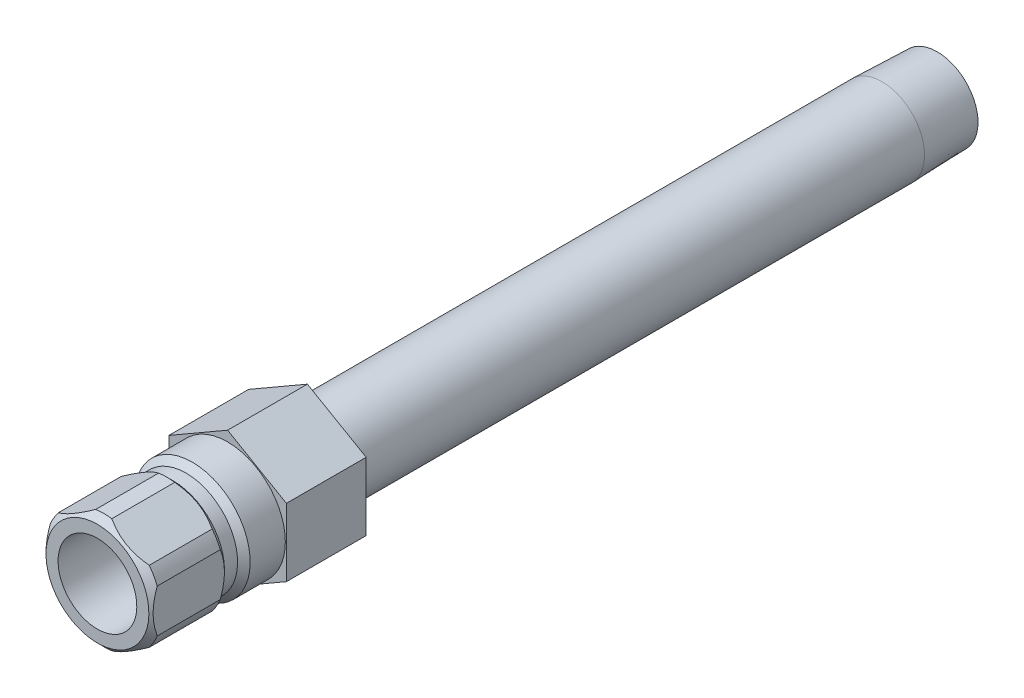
ISO-10303-21;
HEADER;
FILE_DESCRIPTION(('STEP AP214'),'2;1');
FILE_NAME('part.step','',(''),(''),'','','');
FILE_SCHEMA(('AUTOMOTIVE_DESIGN { 1 0 10303 214 1 1 1 1 }'));
ENDSEC;
DATA;
#1=APPLICATION_CONTEXT('core data for automotive mechanical design processes');
#2=APPLICATION_PROTOCOL_DEFINITION('international standard','automotive_design',2000,#1);
#3=PRODUCT_CONTEXT('',#1,'mechanical');
#4=PRODUCT('Part','Part','',(#3));
#5=PRODUCT_RELATED_PRODUCT_CATEGORY('part','',(#4));
#6=PRODUCT_DEFINITION_FORMATION('','',#4);
#7=PRODUCT_DEFINITION_CONTEXT('part definition',#1,'design');
#8=PRODUCT_DEFINITION('design','',#6,#7);
#9=PRODUCT_DEFINITION_SHAPE('','',#8);
#10=(LENGTH_UNIT() NAMED_UNIT(*) SI_UNIT(.MILLI.,.METRE.));
#11=(NAMED_UNIT(*) PLANE_ANGLE_UNIT() SI_UNIT($,.RADIAN.));
#12=(NAMED_UNIT(*) SI_UNIT($,.STERADIAN.) SOLID_ANGLE_UNIT());
#13=UNCERTAINTY_MEASURE_WITH_UNIT(LENGTH_MEASURE(1.E-05),#10,'distance_accuracy_value','');
#14=(GEOMETRIC_REPRESENTATION_CONTEXT(3) GLOBAL_UNCERTAINTY_ASSIGNED_CONTEXT((#13)) GLOBAL_UNIT_ASSIGNED_CONTEXT((#10,
#11,#12)) REPRESENTATION_CONTEXT('',''));
#15=CARTESIAN_POINT('',(0.,0.,0.));
#16=DIRECTION('',(0.,0.,1.));
#17=DIRECTION('',(1.,0.,0.));
#18=AXIS2_PLACEMENT_3D('',#15,#16,#17);
#19=CARTESIAN_POINT('',(0.,0.,-9.652));
#20=DIRECTION('',(0.,0.,-1.));
#21=DIRECTION('',(0.,1.,0.));
#22=AXIS2_PLACEMENT_3D('',#19,#20,#21);
#23=CYLINDRICAL_SURFACE('',#22,6.985);
#24=DIRECTION('',(0.,0.,-1.));
#25=VECTOR('',#24,1.);
#26=CARTESIAN_POINT('',(6.477,2.61509005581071,-9.652));
#27=LINE('',#26,#25);
#28=CARTESIAN_POINT('',(6.477,2.61509005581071,7.366));
#29=VERTEX_POINT('',#28);
#30=CARTESIAN_POINT('',(6.477,2.61509005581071,14.986));
#31=VERTEX_POINT('',#30);
#32=EDGE_CURVE('E372',#29,#31,#27,.F.);
#33=ORIENTED_EDGE('',*,*,#32,.F.);
#34=CARTESIAN_POINT('',(0.,0.,7.366));
#35=DIRECTION('',(0.,0.,-1.));
#36=DIRECTION('',(0.,1.,0.));
#37=AXIS2_PLACEMENT_3D('',#34,#35,#36);
#38=CIRCLE('',#37,6.985);
#39=CARTESIAN_POINT('',(5.50323442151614,4.30170151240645,7.366));
#40=VERTEX_POINT('',#39);
#41=EDGE_CURVE('E190',#40,#29,#38,.T.);
#42=ORIENTED_EDGE('',*,*,#41,.F.);
#43=DIRECTION('',(0.,0.,-1.));
#44=VECTOR('',#43,1.);
#45=CARTESIAN_POINT('',(5.50323442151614,4.30170151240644,-9.652));
#46=LINE('',#45,#44);
#47=CARTESIAN_POINT('',(5.50323442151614,4.30170151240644,14.986));
#48=VERTEX_POINT('',#47);
#49=EDGE_CURVE('E363',#48,#40,#46,.T.);
#50=ORIENTED_EDGE('',*,*,#49,.F.);
#51=CARTESIAN_POINT('',(0.,0.,14.986));
#52=DIRECTION('',(0.,0.,-1.));
#53=DIRECTION('',(0.,1.,0.));
#54=AXIS2_PLACEMENT_3D('',#51,#52,#53);
#55=CIRCLE('',#54,6.985);
#56=EDGE_CURVE('E205',#48,#31,#55,.T.);
#57=ORIENTED_EDGE('',*,*,#56,.T.);
#58=EDGE_LOOP('',(#33,#42,#50,#57));
#59=FACE_BOUND('',#58,.T.);
#60=ADVANCED_FACE('F34',(#59),#23,.T.);
#61=DIRECTION('',(0.,0.,-1.));
#62=VECTOR('',#61,1.);
#63=CARTESIAN_POINT('',(0.97376557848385,6.91679156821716,-9.652));
#64=LINE('',#63,#62);
#65=CARTESIAN_POINT('',(0.973765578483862,6.91679156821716,7.366));
#66=VERTEX_POINT('',#65);
#67=CARTESIAN_POINT('',(0.97376557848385,6.91679156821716,14.986));
#68=VERTEX_POINT('',#67);
#69=EDGE_CURVE('E283',#66,#68,#64,.F.);
#70=ORIENTED_EDGE('',*,*,#69,.F.);
#71=CARTESIAN_POINT('',(-0.973765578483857,6.91679156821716,7.366));
#72=VERTEX_POINT('',#71);
#73=EDGE_CURVE('E194',#72,#66,#38,.T.);
#74=ORIENTED_EDGE('',*,*,#73,.F.);
#75=DIRECTION('',(0.,0.,-1.));
#76=VECTOR('',#75,1.);
#77=CARTESIAN_POINT('',(-0.97376557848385,6.91679156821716,-9.652));
#78=LINE('',#77,#76);
#79=CARTESIAN_POINT('',(-0.97376557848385,6.91679156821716,14.986));
#80=VERTEX_POINT('',#79);
#81=EDGE_CURVE('E54',#80,#72,#78,.T.);
#82=ORIENTED_EDGE('',*,*,#81,.F.);
#83=EDGE_CURVE('E193',#80,#68,#55,.T.);
#84=ORIENTED_EDGE('',*,*,#83,.T.);
#85=EDGE_LOOP('',(#70,#74,#82,#84));
#86=FACE_BOUND('',#85,.T.);
#87=ADVANCED_FACE('F317',(#86),#23,.T.);
#88=DIRECTION('',(0.,0.,-1.));
#89=VECTOR('',#88,1.);
#90=CARTESIAN_POINT('',(-5.50323442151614,4.30170151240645,-9.652));
#91=LINE('',#90,#89);
#92=CARTESIAN_POINT('',(-5.50323442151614,4.30170151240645,7.366));
#93=VERTEX_POINT('',#92);
#94=CARTESIAN_POINT('',(-5.50323442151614,4.30170151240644,14.986));
#95=VERTEX_POINT('',#94);
#96=EDGE_CURVE('E361',#93,#95,#91,.F.);
#97=ORIENTED_EDGE('',*,*,#96,.F.);
#98=CARTESIAN_POINT('',(-6.477,2.6150900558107,7.366));
#99=VERTEX_POINT('',#98);
#100=EDGE_CURVE('E199',#99,#93,#38,.T.);
#101=ORIENTED_EDGE('',*,*,#100,.F.);
#102=DIRECTION('',(0.,0.,-1.));
#103=VECTOR('',#102,1.);
#104=CARTESIAN_POINT('',(-6.477,2.61509005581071,-9.652));
#105=LINE('',#104,#103);
#106=CARTESIAN_POINT('',(-6.477,2.6150900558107,14.986));
#107=VERTEX_POINT('',#106);
#108=EDGE_CURVE('E62',#107,#99,#105,.T.);
#109=ORIENTED_EDGE('',*,*,#108,.F.);
#110=EDGE_CURVE('E204',#107,#95,#55,.T.);
#111=ORIENTED_EDGE('',*,*,#110,.T.);
#112=EDGE_LOOP('',(#97,#101,#109,#111));
#113=FACE_BOUND('',#112,.T.);
#114=ADVANCED_FACE('F322',(#113),#23,.T.);
#115=DIRECTION('',(0.,0.,-1.));
#116=VECTOR('',#115,1.);
#117=CARTESIAN_POINT('',(-6.477,-2.61509005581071,-9.652));
#118=LINE('',#117,#116);
#119=CARTESIAN_POINT('',(-6.477,-2.61509005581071,7.366));
#120=VERTEX_POINT('',#119);
#121=CARTESIAN_POINT('',(-6.477,-2.61509005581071,14.986));
#122=VERTEX_POINT('',#121);
#123=EDGE_CURVE('E353',#120,#122,#118,.F.);
#124=ORIENTED_EDGE('',*,*,#123,.F.);
#125=CARTESIAN_POINT('',(-5.50323442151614,-4.30170151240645,7.366));
#126=VERTEX_POINT('',#125);
#127=EDGE_CURVE('E195',#126,#120,#38,.T.);
#128=ORIENTED_EDGE('',*,*,#127,.F.);
#129=DIRECTION('',(0.,0.,-1.));
#130=VECTOR('',#129,1.);
#131=CARTESIAN_POINT('',(-5.50323442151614,-4.30170151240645,-9.652));
#132=LINE('',#131,#130);
#133=CARTESIAN_POINT('',(-5.50323442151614,-4.30170151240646,14.986));
#134=VERTEX_POINT('',#133);
#135=EDGE_CURVE('E239',#134,#126,#132,.T.);
#136=ORIENTED_EDGE('',*,*,#135,.F.);
#137=EDGE_CURVE('E367',#134,#122,#55,.T.);
#138=ORIENTED_EDGE('',*,*,#137,.T.);
#139=EDGE_LOOP('',(#124,#128,#136,#138));
#140=FACE_BOUND('',#139,.T.);
#141=ADVANCED_FACE('F332',(#140),#23,.T.);
#142=DIRECTION('',(0.,0.,-1.));
#143=VECTOR('',#142,1.);
#144=CARTESIAN_POINT('',(-0.973765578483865,-6.91679156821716,-9.652));
#145=LINE('',#144,#143);
#146=CARTESIAN_POINT('',(-0.973765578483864,-6.91679156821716,7.366));
#147=VERTEX_POINT('',#146);
#148=CARTESIAN_POINT('',(-0.973765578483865,-6.91679156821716,14.986));
#149=VERTEX_POINT('',#148);
#150=EDGE_CURVE('E342',#147,#149,#145,.F.);
#151=ORIENTED_EDGE('',*,*,#150,.F.);
#152=CARTESIAN_POINT('',(0.973765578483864,-6.91679156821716,7.366));
#153=VERTEX_POINT('',#152);
#154=EDGE_CURVE('E191',#153,#147,#38,.T.);
#155=ORIENTED_EDGE('',*,*,#154,.F.);
#156=DIRECTION('',(0.,0.,-1.));
#157=VECTOR('',#156,1.);
#158=CARTESIAN_POINT('',(0.973765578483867,-6.91679156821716,-9.652));
#159=LINE('',#158,#157);
#160=CARTESIAN_POINT('',(0.973765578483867,-6.91679156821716,14.986));
#161=VERTEX_POINT('',#160);
#162=EDGE_CURVE('E168',#161,#153,#159,.T.);
#163=ORIENTED_EDGE('',*,*,#162,.F.);
#164=EDGE_CURVE('E344',#161,#149,#55,.T.);
#165=ORIENTED_EDGE('',*,*,#164,.T.);
#166=EDGE_LOOP('',(#151,#155,#163,#165));
#167=FACE_BOUND('',#166,.T.);
#168=ADVANCED_FACE('F326',(#167),#23,.T.);
#169=CARTESIAN_POINT('',(0.,0.,-9.652));
#170=DIRECTION('',(0.,0.,-1.));
#171=DIRECTION('',(0.,1.,0.));
#172=AXIS2_PLACEMENT_3D('',#169,#170,#171);
#173=CYLINDRICAL_SURFACE('',#172,4.7625);
#174=CARTESIAN_POINT('',(0.,0.,3.556));
#175=DIRECTION('',(0.,0.,-1.));
#176=DIRECTION('',(0.,1.,0.));
#177=AXIS2_PLACEMENT_3D('',#174,#175,#176);
#178=CIRCLE('',#177,4.7625);
#179=CARTESIAN_POINT('',(0.,4.7625,3.556));
#180=VERTEX_POINT('',#179);
#181=EDGE_CURVE('E420',#180,#180,#178,.T.);
#182=ORIENTED_EDGE('',*,*,#181,.T.);
#183=EDGE_LOOP('',(#182));
#184=FACE_BOUND('',#183,.T.);
#185=CARTESIAN_POINT('',(0.,0.,15.748));
#186=DIRECTION('',(0.,0.,-1.));
#187=DIRECTION('',(0.,1.,0.));
#188=AXIS2_PLACEMENT_3D('',#185,#186,#187);
#189=CIRCLE('',#188,4.7625);
#190=CARTESIAN_POINT('',(0.,4.7625,15.748));
#191=VERTEX_POINT('',#190);
#192=EDGE_CURVE('E209',#191,#191,#189,.T.);
#193=ORIENTED_EDGE('',*,*,#192,.F.);
#194=EDGE_LOOP('',(#193));
#195=FACE_BOUND('',#194,.T.);
#196=ADVANCED_FACE('F36',(#184,#195),#173,.F.);
#197=CARTESIAN_POINT('',(0.,4.7625,15.748));
#198=DIRECTION('',(0.,0.,1.));
#199=DIRECTION('',(0.,-1.,0.));
#200=AXIS2_PLACEMENT_3D('',#197,#198,#199);
#201=PLANE('',#200);
#202=ORIENTED_EDGE('',*,*,#192,.T.);
#203=EDGE_LOOP('',(#202));
#204=FACE_BOUND('',#203,.T.);
#205=CARTESIAN_POINT('',(0.,0.,15.748));
#206=DIRECTION('',(0.,0.,-1.));
#207=DIRECTION('',(0.,1.,0.));
#208=AXIS2_PLACEMENT_3D('',#205,#206,#207);
#209=CIRCLE('',#208,6.223);
#210=CARTESIAN_POINT('',(0.,6.223,15.748));
#211=VERTEX_POINT('',#210);
#212=EDGE_CURVE('E206',#211,#211,#209,.T.);
#213=ORIENTED_EDGE('',*,*,#212,.F.);
#214=EDGE_LOOP('',(#213));
#215=FACE_BOUND('',#214,.T.);
#216=ADVANCED_FACE('F245',(#204,#215),#201,.T.);
#217=CARTESIAN_POINT('',(0.,0.,14.986));
#218=DIRECTION('',(0.,0.,-1.));
#219=DIRECTION('',(0.,1.,0.));
#220=AXIS2_PLACEMENT_3D('',#217,#218,#219);
#221=CONICAL_SURFACE('',#220,6.985,0.785398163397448);
#222=CARTESIAN_POINT('',(6.477,-7.50531717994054,12.0573066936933));
#223=CARTESIAN_POINT('',(6.477,-7.32278230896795,12.1954662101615));
#224=CARTESIAN_POINT('',(6.477,-7.13923073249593,12.3323042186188));
#225=CARTESIAN_POINT('',(6.477,-6.76969107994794,12.6027438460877));
#226=CARTESIAN_POINT('',(6.477,-6.58370240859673,12.7363446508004));
#227=CARTESIAN_POINT('',(6.477,-6.20752484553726,13.0006667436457));
#228=CARTESIAN_POINT('',(6.477,-6.01731457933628,13.1313577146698));
#229=CARTESIAN_POINT('',(6.477,-5.63367369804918,13.3879087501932));
#230=CARTESIAN_POINT('',(6.477,-5.44024331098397,13.5137691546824));
#231=CARTESIAN_POINT('',(6.477,-5.03831720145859,13.7667102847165));
#232=CARTESIAN_POINT('',(6.477,-4.82959841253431,13.8934383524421));
#233=CARTESIAN_POINT('',(6.477,-4.4072839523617,14.1386241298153));
#234=CARTESIAN_POINT('',(6.477,-4.19368750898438,14.2570805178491));
#235=CARTESIAN_POINT('',(6.477,-3.76162676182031,14.4831715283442));
#236=CARTESIAN_POINT('',(6.477,-3.54317924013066,14.5908379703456));
#237=CARTESIAN_POINT('',(6.477,-3.10029556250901,14.7929384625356));
#238=CARTESIAN_POINT('',(6.477,-2.87586219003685,14.8873785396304));
#239=CARTESIAN_POINT('',(6.477,-2.43955826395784,15.0524966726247));
#240=CARTESIAN_POINT('',(6.477,-2.22819339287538,15.1244971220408));
#241=CARTESIAN_POINT('',(6.477,-1.80033354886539,15.2515475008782));
#242=CARTESIAN_POINT('',(6.477,-1.58383822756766,15.3065962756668));
#243=CARTESIAN_POINT('',(6.477,-1.1506339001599,15.3959385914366));
#244=CARTESIAN_POINT('',(6.477,-0.934000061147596,15.4305906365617));
#245=CARTESIAN_POINT('',(6.477,-0.498364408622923,15.4784594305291));
#246=CARTESIAN_POINT('',(6.477,-0.2793630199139,15.4916799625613));
#247=CARTESIAN_POINT('',(6.477,0.150697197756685,15.4956835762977));
#248=CARTESIAN_POINT('',(6.477,0.361748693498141,15.4872823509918));
#249=CARTESIAN_POINT('',(6.477,0.782066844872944,15.4503172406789));
#250=CARTESIAN_POINT('',(6.477,0.991333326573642,15.421751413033));
#251=CARTESIAN_POINT('',(6.477,1.41010575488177,15.3455375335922));
#252=CARTESIAN_POINT('',(6.477,1.6195513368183,15.2975631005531));
#253=CARTESIAN_POINT('',(6.477,2.03387291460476,15.1851046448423));
#254=CARTESIAN_POINT('',(6.477,2.23874927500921,15.1206219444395));
#255=CARTESIAN_POINT('',(6.477,2.66141718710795,14.9715598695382));
#256=CARTESIAN_POINT('',(6.477,2.87875617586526,14.8857103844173));
#257=CARTESIAN_POINT('',(6.477,3.30779766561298,14.7008180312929));
#258=CARTESIAN_POINT('',(6.477,3.51949749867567,14.6017690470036));
#259=CARTESIAN_POINT('',(6.477,3.93828980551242,14.3928329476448));
#260=CARTESIAN_POINT('',(6.477,4.14536521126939,14.282911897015));
#261=CARTESIAN_POINT('',(6.477,4.55475391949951,14.0546596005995));
#262=CARTESIAN_POINT('',(6.477,4.75706796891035,13.93632968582));
#263=CARTESIAN_POINT('',(6.477,5.14761370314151,13.6989609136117));
#264=CARTESIAN_POINT('',(6.477,5.33604552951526,13.580249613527));
#265=CARTESIAN_POINT('',(6.477,5.70967381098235,13.3378251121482));
#266=CARTESIAN_POINT('',(6.477,5.89487001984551,13.2141115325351));
#267=CARTESIAN_POINT('',(6.477,6.26095063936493,12.9635958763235));
#268=CARTESIAN_POINT('',(6.477,6.4418578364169,12.8368269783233));
#269=CARTESIAN_POINT('',(6.477,6.80119835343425,12.5799293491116));
#270=CARTESIAN_POINT('',(6.477,6.97963234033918,12.4498015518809));
#271=CARTESIAN_POINT('',(6.477,7.15703038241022,12.3183002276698));
#272=B_SPLINE_CURVE_WITH_KNOTS('',3,(#222,#223,#224,#225,#226,#227,#228,#229,#230,#231,#232,
#233,#234,#235,#236,#237,#238,#239,#240,#241,#242,#243,#244,#245,#246,#247,#248,#249,#250,#251,
#252,#253,#254,#255,#256,#257,#258,#259,#260,#261,#262,#263,#264,#265,#266,#267,#268,#269,#270,
#271),.UNSPECIFIED.,.F.,.F.,(4,2,2,2,2,2,2,2,2,2,2,2,2,2,2,2,2,2,2,2,2,2,2,2,4),(0.,
0.68679090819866,1.37375281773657,2.06603541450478,2.75826919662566,3.49065471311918,
4.22315698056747,4.95343127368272,5.68337170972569,6.35265989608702,7.02199365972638,
7.67918147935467,8.33625327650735,8.96890298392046,9.60161364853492,10.2454384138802,
10.8892116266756,11.5897073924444,12.2905288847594,12.9936114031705,13.696582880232,
14.3646145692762,15.0326968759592,15.6953618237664,16.3578444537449),.UNSPECIFIED.);
#273=CARTESIAN_POINT('',(6.477,-2.61509005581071,14.986));
#274=VERTEX_POINT('',#273);
#275=EDGE_CURVE('E375',#31,#274,#272,.F.);
#276=ORIENTED_EDGE('',*,*,#275,.F.);
#277=ORIENTED_EDGE('',*,*,#56,.F.);
#278=CARTESIAN_POINT('',(0.973302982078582,6.91705864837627,14.9858));
#279=CARTESIAN_POINT('',(1.1543052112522,6.81255696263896,15.0641166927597));
#280=CARTESIAN_POINT('',(1.3378209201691,6.70660411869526,15.1353544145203));
#281=CARTESIAN_POINT('',(1.70963160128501,6.49193912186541,15.2608524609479));
#282=CARTESIAN_POINT('',(1.89793754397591,6.38322063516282,15.3150691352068));
#283=CARTESIAN_POINT('',(2.27146153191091,6.16756646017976,15.401724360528));
#284=CARTESIAN_POINT('',(2.45655498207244,6.06070270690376,15.4348622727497));
#285=CARTESIAN_POINT('',(2.82844640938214,5.8459910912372,15.4802195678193));
#286=CARTESIAN_POINT('',(3.0152419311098,5.73814464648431,15.4924653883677));
#287=CARTESIAN_POINT('',(3.3948057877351,5.51900335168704,15.4953056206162));
#288=CARTESIAN_POINT('',(3.58757842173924,5.40770601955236,15.4852117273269));
#289=CARTESIAN_POINT('',(3.97148128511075,5.18605959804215,15.4426708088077));
#290=CARTESIAN_POINT('',(4.16260891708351,5.0757120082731,15.4101933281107));
#291=CARTESIAN_POINT('',(4.54854122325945,4.85289388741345,15.3234273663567));
#292=CARTESIAN_POINT('',(4.74321398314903,4.74049951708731,15.268364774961));
#293=CARTESIAN_POINT('',(5.03141021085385,4.5741093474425,15.1720079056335));
#294=CARTESIAN_POINT('',(5.12673323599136,4.51907457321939,15.1376422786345));
#295=CARTESIAN_POINT('',(5.31613879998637,4.40972121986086,15.0647445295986));
#296=CARTESIAN_POINT('',(5.41022179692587,4.35540237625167,15.0262139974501));
#297=CARTESIAN_POINT('',(5.50369701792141,4.30143443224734,14.9858));
#298=B_SPLINE_CURVE_WITH_KNOTS('',3,(#278,#279,#280,#281,#282,#283,#284,#285,#286,#287,#288,
#289,#290,#291,#292,#293,#294,#295,#296,#297),.UNSPECIFIED.,.F.,.F.,(4,2,2,2,2,2,2,2,2,4),(0.,
0.669810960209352,1.34132587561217,1.98920541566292,2.63626449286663,3.30353665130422,
3.97171850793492,4.66502165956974,5.01088265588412,5.35661208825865),.UNSPECIFIED.);
#299=EDGE_CURVE('E275',#68,#48,#298,.T.);
#300=ORIENTED_EDGE('',*,*,#299,.F.);
#301=ORIENTED_EDGE('',*,*,#83,.F.);
#302=CARTESIAN_POINT('',(-5.50369701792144,4.30143443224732,14.9858));
#303=CARTESIAN_POINT('',(-5.32269478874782,4.40593611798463,15.0641166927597));
#304=CARTESIAN_POINT('',(-5.13917907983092,4.51188896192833,15.1353544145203));
#305=CARTESIAN_POINT('',(-4.76736839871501,4.72655395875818,15.2608524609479));
#306=CARTESIAN_POINT('',(-4.57906245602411,4.83527244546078,15.3150691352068));
#307=CARTESIAN_POINT('',(-4.2055384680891,5.05092662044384,15.401724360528));
#308=CARTESIAN_POINT('',(-4.02044501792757,5.15779037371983,15.4348622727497));
#309=CARTESIAN_POINT('',(-3.64855359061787,5.3725019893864,15.4802195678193));
#310=CARTESIAN_POINT('',(-3.46175806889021,5.48034843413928,15.4924653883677));
#311=CARTESIAN_POINT('',(-3.0821942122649,5.69948972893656,15.4953056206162));
#312=CARTESIAN_POINT('',(-2.88942157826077,5.81078706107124,15.4852117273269));
#313=CARTESIAN_POINT('',(-2.50551871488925,6.03243348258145,15.4426708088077));
#314=CARTESIAN_POINT('',(-2.31439108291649,6.1427810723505,15.4101933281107));
#315=CARTESIAN_POINT('',(-1.92845877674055,6.36559919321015,15.3234273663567));
#316=CARTESIAN_POINT('',(-1.73378601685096,6.47799356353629,15.268364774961));
#317=CARTESIAN_POINT('',(-1.44558978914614,6.64438373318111,15.1720079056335));
#318=CARTESIAN_POINT('',(-1.35026676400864,6.69941850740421,15.1376422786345));
#319=CARTESIAN_POINT('',(-1.16086120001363,6.80877186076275,15.0647445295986));
#320=CARTESIAN_POINT('',(-1.06677820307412,6.86309070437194,15.0262139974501));
#321=CARTESIAN_POINT('',(-0.973302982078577,6.91705864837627,14.9858));
#322=B_SPLINE_CURVE_WITH_KNOTS('',3,(#302,#303,#304,#305,#306,#307,#308,#309,#310,#311,#312,
#313,#314,#315,#316,#317,#318,#319,#320,#321),.UNSPECIFIED.,.F.,.F.,(4,2,2,2,2,2,2,2,2,4),(0.,
0.669810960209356,1.34132587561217,1.98920541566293,2.63626449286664,3.30353665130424,
3.97171850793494,4.66502165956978,5.01088265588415,5.35661208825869),.UNSPECIFIED.);
#323=EDGE_CURVE('E267',#95,#80,#322,.T.);
#324=ORIENTED_EDGE('',*,*,#323,.F.);
#325=ORIENTED_EDGE('',*,*,#110,.F.);
#326=CARTESIAN_POINT('',(-6.477,-7.50531717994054,12.0573066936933));
#327=CARTESIAN_POINT('',(-6.477,-7.32278230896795,12.1954662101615));
#328=CARTESIAN_POINT('',(-6.477,-7.13923073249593,12.3323042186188));
#329=CARTESIAN_POINT('',(-6.477,-6.76969107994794,12.6027438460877));
#330=CARTESIAN_POINT('',(-6.477,-6.58370240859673,12.7363446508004));
#331=CARTESIAN_POINT('',(-6.477,-6.20752484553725,13.0006667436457));
#332=CARTESIAN_POINT('',(-6.477,-6.01731457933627,13.1313577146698));
#333=CARTESIAN_POINT('',(-6.477,-5.63367369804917,13.3879087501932));
#334=CARTESIAN_POINT('',(-6.477,-5.44024331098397,13.5137691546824));
#335=CARTESIAN_POINT('',(-6.477,-5.03831720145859,13.7667102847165));
#336=CARTESIAN_POINT('',(-6.477,-4.8295984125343,13.8934383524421));
#337=CARTESIAN_POINT('',(-6.477,-4.4072839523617,14.1386241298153));
#338=CARTESIAN_POINT('',(-6.477,-4.19368750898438,14.2570805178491));
#339=CARTESIAN_POINT('',(-6.477,-3.7616267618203,14.4831715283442));
#340=CARTESIAN_POINT('',(-6.477,-3.54317924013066,14.5908379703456));
#341=CARTESIAN_POINT('',(-6.477,-3.100295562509,14.7929384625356));
#342=CARTESIAN_POINT('',(-6.477,-2.87586219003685,14.8873785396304));
#343=CARTESIAN_POINT('',(-6.477,-2.43955826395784,15.0524966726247));
#344=CARTESIAN_POINT('',(-6.477,-2.22819339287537,15.1244971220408));
#345=CARTESIAN_POINT('',(-6.477,-1.80033354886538,15.2515475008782));
#346=CARTESIAN_POINT('',(-6.477,-1.58383822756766,15.3065962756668));
#347=CARTESIAN_POINT('',(-6.477,-1.15063390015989,15.3959385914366));
#348=CARTESIAN_POINT('',(-6.477,-0.934000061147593,15.4305906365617));
#349=CARTESIAN_POINT('',(-6.477,-0.498364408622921,15.4784594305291));
#350=CARTESIAN_POINT('',(-6.477,-0.279363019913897,15.4916799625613));
#351=CARTESIAN_POINT('',(-6.477,0.150697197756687,15.4956835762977));
#352=CARTESIAN_POINT('',(-6.477,0.361748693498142,15.4872823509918));
#353=CARTESIAN_POINT('',(-6.477,0.782066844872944,15.4503172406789));
#354=CARTESIAN_POINT('',(-6.477,0.991333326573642,15.421751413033));
#355=CARTESIAN_POINT('',(-6.477,1.41010575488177,15.3455375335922));
#356=CARTESIAN_POINT('',(-6.477,1.6195513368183,15.2975631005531));
#357=CARTESIAN_POINT('',(-6.477,2.03387291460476,15.1851046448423));
#358=CARTESIAN_POINT('',(-6.477,2.23874927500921,15.1206219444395));
#359=CARTESIAN_POINT('',(-6.477,2.66141718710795,14.9715598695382));
#360=CARTESIAN_POINT('',(-6.477,2.87875617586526,14.8857103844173));
#361=CARTESIAN_POINT('',(-6.477,3.30779766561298,14.7008180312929));
#362=CARTESIAN_POINT('',(-6.477,3.51949749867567,14.6017690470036));
#363=CARTESIAN_POINT('',(-6.477,3.93828980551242,14.3928329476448));
#364=CARTESIAN_POINT('',(-6.477,4.14536521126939,14.282911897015));
#365=CARTESIAN_POINT('',(-6.477,4.55475391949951,14.0546596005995));
#366=CARTESIAN_POINT('',(-6.477,4.75706796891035,13.93632968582));
#367=CARTESIAN_POINT('',(-6.477,5.14761370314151,13.6989609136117));
#368=CARTESIAN_POINT('',(-6.477,5.33604552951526,13.580249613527));
#369=CARTESIAN_POINT('',(-6.477,5.70967381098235,13.3378251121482));
#370=CARTESIAN_POINT('',(-6.477,5.89487001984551,13.2141115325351));
#371=CARTESIAN_POINT('',(-6.477,6.26095063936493,12.9635958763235));
#372=CARTESIAN_POINT('',(-6.477,6.4418578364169,12.8368269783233));
#373=CARTESIAN_POINT('',(-6.477,6.80119835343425,12.5799293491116));
#374=CARTESIAN_POINT('',(-6.477,6.97963234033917,12.4498015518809));
#375=CARTESIAN_POINT('',(-6.477,7.15703038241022,12.3183002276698));
#376=B_SPLINE_CURVE_WITH_KNOTS('',3,(#326,#327,#328,#329,#330,#331,#332,#333,#334,#335,#336,
#337,#338,#339,#340,#341,#342,#343,#344,#345,#346,#347,#348,#349,#350,#351,#352,#353,#354,#355,
#356,#357,#358,#359,#360,#361,#362,#363,#364,#365,#366,#367,#368,#369,#370,#371,#372,#373,#374,
#375),.UNSPECIFIED.,.F.,.F.,(4,2,2,2,2,2,2,2,2,2,2,2,2,2,2,2,2,2,2,2,2,2,2,2,4),(0.,
0.686790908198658,1.37375281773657,2.06603541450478,2.75826919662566,3.49065471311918,
4.22315698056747,4.95343127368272,5.68337170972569,6.35265989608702,7.02199365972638,
7.67918147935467,8.33625327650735,8.96890298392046,9.60161364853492,10.2454384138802,
10.8892116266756,11.5897073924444,12.2905288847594,12.9936114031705,13.696582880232,
14.3646145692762,15.0326968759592,15.6953618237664,16.3578444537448),.UNSPECIFIED.);
#377=EDGE_CURVE('E260',#122,#107,#376,.T.);
#378=ORIENTED_EDGE('',*,*,#377,.F.);
#379=ORIENTED_EDGE('',*,*,#137,.F.);
#380=CARTESIAN_POINT('',(-0.973302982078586,-6.91705864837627,14.9858));
#381=CARTESIAN_POINT('',(-1.1543052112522,-6.81255696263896,15.0641166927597));
#382=CARTESIAN_POINT('',(-1.3378209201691,-6.70660411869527,15.1353544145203));
#383=CARTESIAN_POINT('',(-1.70963160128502,-6.49193912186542,15.2608524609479));
#384=CARTESIAN_POINT('',(-1.89793754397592,-6.38322063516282,15.3150691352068));
#385=CARTESIAN_POINT('',(-2.27146153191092,-6.16756646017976,15.401724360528));
#386=CARTESIAN_POINT('',(-2.45655498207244,-6.06070270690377,15.4348622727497));
#387=CARTESIAN_POINT('',(-2.82844640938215,-5.8459910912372,15.4802195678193));
#388=CARTESIAN_POINT('',(-3.0152419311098,-5.73814464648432,15.4924653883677));
#389=CARTESIAN_POINT('',(-3.39480578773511,-5.51900335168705,15.4953056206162));
#390=CARTESIAN_POINT('',(-3.58757842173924,-5.40770601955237,15.4852117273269));
#391=CARTESIAN_POINT('',(-3.97148128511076,-5.18605959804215,15.4426708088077));
#392=CARTESIAN_POINT('',(-4.16260891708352,-5.0757120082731,15.4101933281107));
#393=CARTESIAN_POINT('',(-4.54854122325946,-4.85289388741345,15.3234273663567));
#394=CARTESIAN_POINT('',(-4.74321398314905,-4.74049951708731,15.268364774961));
#395=CARTESIAN_POINT('',(-5.03141021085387,-4.57410934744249,15.1720079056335));
#396=CARTESIAN_POINT('',(-5.12673323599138,-4.51907457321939,15.1376422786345));
#397=CARTESIAN_POINT('',(-5.31613879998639,-4.40972121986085,15.0647445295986));
#398=CARTESIAN_POINT('',(-5.4102217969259,-4.35540237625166,15.0262139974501));
#399=CARTESIAN_POINT('',(-5.50369701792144,-4.30143443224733,14.9858));
#400=B_SPLINE_CURVE_WITH_KNOTS('',3,(#380,#381,#382,#383,#384,#385,#386,#387,#388,#389,#390,
#391,#392,#393,#394,#395,#396,#397,#398,#399),.UNSPECIFIED.,.F.,.F.,(4,2,2,2,2,2,2,2,2,4),(0.,
0.669810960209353,1.34132587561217,1.98920541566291,2.63626449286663,3.30353665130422,
3.97171850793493,4.66502165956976,5.01088265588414,5.35661208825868),.UNSPECIFIED.);
#401=EDGE_CURVE('E253',#149,#134,#400,.T.);
#402=ORIENTED_EDGE('',*,*,#401,.F.);
#403=ORIENTED_EDGE('',*,*,#164,.F.);
#404=CARTESIAN_POINT('',(5.50369701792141,-4.30143443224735,14.9858));
#405=CARTESIAN_POINT('',(5.32269478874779,-4.40593611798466,15.0641166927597));
#406=CARTESIAN_POINT('',(5.13917907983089,-4.51188896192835,15.1353544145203));
#407=CARTESIAN_POINT('',(4.76736839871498,-4.7265539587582,15.2608524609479));
#408=CARTESIAN_POINT('',(4.57906245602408,-4.8352724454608,15.3150691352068));
#409=CARTESIAN_POINT('',(4.20553846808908,-5.05092662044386,15.401724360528));
#410=CARTESIAN_POINT('',(4.02044501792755,-5.15779037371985,15.4348622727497));
#411=CARTESIAN_POINT('',(3.64855359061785,-5.37250198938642,15.4802195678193));
#412=CARTESIAN_POINT('',(3.46175806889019,-5.4803484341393,15.4924653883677));
#413=CARTESIAN_POINT('',(3.08219421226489,-5.69948972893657,15.4953056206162));
#414=CARTESIAN_POINT('',(2.88942157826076,-5.81078706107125,15.4852117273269));
#415=CARTESIAN_POINT('',(2.50551871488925,-6.03243348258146,15.4426708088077));
#416=CARTESIAN_POINT('',(2.31439108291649,-6.14278107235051,15.4101933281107));
#417=CARTESIAN_POINT('',(1.92845877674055,-6.36559919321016,15.3234273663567));
#418=CARTESIAN_POINT('',(1.73378601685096,-6.4779935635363,15.268364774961));
#419=CARTESIAN_POINT('',(1.44558978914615,-6.64438373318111,15.1720079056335));
#420=CARTESIAN_POINT('',(1.35026676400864,-6.69941850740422,15.1376422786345));
#421=CARTESIAN_POINT('',(1.16086120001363,-6.80877186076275,15.0647445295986));
#422=CARTESIAN_POINT('',(1.06677820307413,-6.86309070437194,15.0262139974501));
#423=CARTESIAN_POINT('',(0.973302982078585,-6.91705864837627,14.9858));
#424=B_SPLINE_CURVE_WITH_KNOTS('',3,(#404,#405,#406,#407,#408,#409,#410,#411,#412,#413,#414,
#415,#416,#417,#418,#419,#420,#421,#422,#423),.UNSPECIFIED.,.F.,.F.,(4,2,2,2,2,2,2,2,2,4),(0.,
0.669810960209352,1.34132587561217,1.98920541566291,2.63626449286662,3.30353665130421,
3.9717185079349,4.66502165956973,5.0108826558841,5.35661208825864),.UNSPECIFIED.);
#425=CARTESIAN_POINT('',(5.50323442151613,-4.30170151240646,14.986));
#426=VERTEX_POINT('',#425);
#427=EDGE_CURVE('E184',#426,#161,#424,.T.);
#428=ORIENTED_EDGE('',*,*,#427,.F.);
#429=EDGE_CURVE('E183',#274,#426,#55,.T.);
#430=ORIENTED_EDGE('',*,*,#429,.F.);
#431=EDGE_LOOP('',(#276,#277,#300,#301,#324,#325,#378,#379,#402,#403,#428,#430));
#432=FACE_BOUND('',#431,.T.);
#433=ORIENTED_EDGE('',*,*,#212,.T.);
#434=EDGE_LOOP('',(#433));
#435=FACE_BOUND('',#434,.T.);
#436=ADVANCED_FACE('F242',(#432,#435),#221,.T.);
#437=DIRECTION('',(0.,0.,-1.));
#438=VECTOR('',#437,1.);
#439=CARTESIAN_POINT('',(6.477,-2.61509005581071,-9.652));
#440=LINE('',#439,#438);
#441=CARTESIAN_POINT('',(6.477,-2.61509005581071,7.366));
#442=VERTEX_POINT('',#441);
#443=EDGE_CURVE('E282',#274,#442,#440,.T.);
#444=ORIENTED_EDGE('',*,*,#443,.F.);
#445=ORIENTED_EDGE('',*,*,#429,.T.);
#446=DIRECTION('',(0.,0.,-1.));
#447=VECTOR('',#446,1.);
#448=CARTESIAN_POINT('',(5.50323442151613,-4.30170151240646,-9.652));
#449=LINE('',#448,#447);
#450=CARTESIAN_POINT('',(5.50323442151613,-4.30170151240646,7.366));
#451=VERTEX_POINT('',#450);
#452=EDGE_CURVE('E165',#451,#426,#449,.F.);
#453=ORIENTED_EDGE('',*,*,#452,.F.);
#454=EDGE_CURVE('E181',#442,#451,#38,.T.);
#455=ORIENTED_EDGE('',*,*,#454,.F.);
#456=EDGE_LOOP('',(#444,#445,#453,#455));
#457=FACE_BOUND('',#456,.T.);
#458=ADVANCED_FACE('F180',(#457),#23,.T.);
#459=CARTESIAN_POINT('',(0.,0.,6.604));
#460=DIRECTION('',(0.,0.,1.));
#461=DIRECTION('',(0.,-1.,0.));
#462=AXIS2_PLACEMENT_3D('',#459,#460,#461);
#463=CONICAL_SURFACE('',#462,6.223,0.785398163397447);
#464=CARTESIAN_POINT('',(6.477,-7.50531717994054,10.2946933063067));
#465=CARTESIAN_POINT('',(6.477,-7.32278230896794,10.1565337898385));
#466=CARTESIAN_POINT('',(6.477,-7.13923073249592,10.0196957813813));
#467=CARTESIAN_POINT('',(6.477,-6.76969107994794,9.74925615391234));
#468=CARTESIAN_POINT('',(6.477,-6.58370240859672,9.61565534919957));
#469=CARTESIAN_POINT('',(6.477,-6.20752484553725,9.35133325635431));
#470=CARTESIAN_POINT('',(6.477,-6.01731457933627,9.22064228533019));
#471=CARTESIAN_POINT('',(6.477,-5.63367369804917,8.96409124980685));
#472=CARTESIAN_POINT('',(6.477,-5.44024331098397,8.83823084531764));
#473=CARTESIAN_POINT('',(6.477,-5.03831720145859,8.58528971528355));
#474=CARTESIAN_POINT('',(6.477,-4.82959841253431,8.45856164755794));
#475=CARTESIAN_POINT('',(6.477,-4.4072839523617,8.21337587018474));
#476=CARTESIAN_POINT('',(6.477,-4.19368750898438,8.09491948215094));
#477=CARTESIAN_POINT('',(6.477,-3.76162676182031,7.8688284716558));
#478=CARTESIAN_POINT('',(6.477,-3.54317924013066,7.76116202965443));
#479=CARTESIAN_POINT('',(6.477,-3.10029556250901,7.55906153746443));
#480=CARTESIAN_POINT('',(6.477,-2.87586219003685,7.46462146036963));
#481=CARTESIAN_POINT('',(6.477,-2.43955826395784,7.2995033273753));
#482=CARTESIAN_POINT('',(6.477,-2.22819339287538,7.2275028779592));
#483=CARTESIAN_POINT('',(6.477,-1.80033354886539,7.10045249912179));
#484=CARTESIAN_POINT('',(6.477,-1.58383822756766,7.0454037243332));
#485=CARTESIAN_POINT('',(6.477,-1.1506339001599,6.95606140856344));
#486=CARTESIAN_POINT('',(6.477,-0.934000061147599,6.92140936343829));
#487=CARTESIAN_POINT('',(6.477,-0.498364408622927,6.87354056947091));
#488=CARTESIAN_POINT('',(6.477,-0.279363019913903,6.86032003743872));
#489=CARTESIAN_POINT('',(6.477,0.15069719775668,6.85631642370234));
#490=CARTESIAN_POINT('',(6.477,0.361748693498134,6.8647176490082));
#491=CARTESIAN_POINT('',(6.477,0.782066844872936,6.90168275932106));
#492=CARTESIAN_POINT('',(6.477,0.991333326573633,6.93024858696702));
#493=CARTESIAN_POINT('',(6.477,1.41010575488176,7.00646246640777));
#494=CARTESIAN_POINT('',(6.477,1.61955133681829,7.05443689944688));
#495=CARTESIAN_POINT('',(6.477,2.03387291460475,7.16689535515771));
#496=CARTESIAN_POINT('',(6.477,2.2387492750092,7.23137805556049));
#497=CARTESIAN_POINT('',(6.477,2.66141718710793,7.38044013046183));
#498=CARTESIAN_POINT('',(6.477,2.87875617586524,7.46628961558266));
#499=CARTESIAN_POINT('',(6.477,3.30779766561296,7.65118196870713));
#500=CARTESIAN_POINT('',(6.477,3.51949749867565,7.75023095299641));
#501=CARTESIAN_POINT('',(6.477,3.93828980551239,7.95916705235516));
#502=CARTESIAN_POINT('',(6.477,4.14536521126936,8.069088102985));
#503=CARTESIAN_POINT('',(6.477,4.55475391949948,8.29734039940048));
#504=CARTESIAN_POINT('',(6.477,4.75706796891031,8.41567031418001));
#505=CARTESIAN_POINT('',(6.477,5.14761370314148,8.65303908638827));
#506=CARTESIAN_POINT('',(6.477,5.33604552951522,8.77175038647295));
#507=CARTESIAN_POINT('',(6.477,5.70967381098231,9.01417488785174));
#508=CARTESIAN_POINT('',(6.477,5.89487001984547,9.13788846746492));
#509=CARTESIAN_POINT('',(6.477,6.26095063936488,9.38840412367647));
#510=CARTESIAN_POINT('',(6.477,6.44185783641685,9.5151730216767));
#511=CARTESIAN_POINT('',(6.477,6.8011983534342,9.77207065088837));
#512=CARTESIAN_POINT('',(6.477,6.97963234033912,9.90219844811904));
#513=CARTESIAN_POINT('',(6.477,7.15703038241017,10.0336997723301));
#514=B_SPLINE_CURVE_WITH_KNOTS('',3,(#464,#465,#466,#467,#468,#469,#470,#471,#472,#473,#474,
#475,#476,#477,#478,#479,#480,#481,#482,#483,#484,#485,#486,#487,#488,#489,#490,#491,#492,#493,
#494,#495,#496,#497,#498,#499,#500,#501,#502,#503,#504,#505,#506,#507,#508,#509,#510,#511,#512,
#513),.UNSPECIFIED.,.F.,.F.,(4,2,2,2,2,2,2,2,2,2,2,2,2,2,2,2,2,2,2,2,2,2,2,2,4),(0.,
0.686790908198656,1.37375281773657,2.06603541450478,2.75826919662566,3.49065471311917,
4.22315698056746,4.95343127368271,5.68337170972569,6.35265989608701,7.02199365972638,
7.67918147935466,8.33625327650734,8.96890298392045,9.6016136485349,10.2454384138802,
10.8892116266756,11.5897073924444,12.2905288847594,12.9936114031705,13.6965828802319,
14.3646145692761,15.0326968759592,15.6953618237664,16.3578444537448),.UNSPECIFIED.);
#515=EDGE_CURVE('E12',#442,#29,#514,.T.);
#516=ORIENTED_EDGE('',*,*,#515,.F.);
#517=ORIENTED_EDGE('',*,*,#454,.T.);
#518=CARTESIAN_POINT('',(0.973302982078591,-6.91705864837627,7.3662));
#519=CARTESIAN_POINT('',(1.15430521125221,-6.81255696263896,7.28788330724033));
#520=CARTESIAN_POINT('',(1.33782092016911,-6.70660411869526,7.21664558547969));
#521=CARTESIAN_POINT('',(1.70963160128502,-6.49193912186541,7.09114753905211));
#522=CARTESIAN_POINT('',(1.89793754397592,-6.38322063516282,7.03693086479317));
#523=CARTESIAN_POINT('',(2.27146153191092,-6.16756646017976,6.95027563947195));
#524=CARTESIAN_POINT('',(2.45655498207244,-6.06070270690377,6.91713772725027));
#525=CARTESIAN_POINT('',(2.82844640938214,-5.8459910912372,6.87178043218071));
#526=CARTESIAN_POINT('',(3.0152419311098,-5.73814464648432,6.85953461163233));
#527=CARTESIAN_POINT('',(3.3948057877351,-5.51900335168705,6.85669437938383));
#528=CARTESIAN_POINT('',(3.58757842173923,-5.40770601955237,6.86678827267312));
#529=CARTESIAN_POINT('',(3.97148128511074,-5.18605959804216,6.90932919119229));
#530=CARTESIAN_POINT('',(4.1626089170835,-5.07571200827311,6.94180667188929));
#531=CARTESIAN_POINT('',(4.54854122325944,-4.85289388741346,7.02857263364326));
#532=CARTESIAN_POINT('',(4.74321398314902,-4.74049951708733,7.08363522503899));
#533=CARTESIAN_POINT('',(5.03141021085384,-4.57410934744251,7.17999209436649));
#534=CARTESIAN_POINT('',(5.12673323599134,-4.51907457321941,7.21435772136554));
#535=CARTESIAN_POINT('',(5.31613879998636,-4.40972121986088,7.28725547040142));
#536=CARTESIAN_POINT('',(5.41022179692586,-4.35540237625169,7.32578600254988));
#537=CARTESIAN_POINT('',(5.5036970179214,-4.30143443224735,7.3662));
#538=B_SPLINE_CURVE_WITH_KNOTS('',3,(#518,#519,#520,#521,#522,#523,#524,#525,#526,#527,#528,
#529,#530,#531,#532,#533,#534,#535,#536,#537),.UNSPECIFIED.,.F.,.F.,(4,2,2,2,2,2,2,2,2,4),(0.,
0.669810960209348,1.34132587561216,1.98920541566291,2.63626449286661,3.3035366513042,
3.97171850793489,4.66502165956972,5.01088265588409,5.35661208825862),.UNSPECIFIED.);
#539=EDGE_CURVE('E162',#153,#451,#538,.T.);
#540=ORIENTED_EDGE('',*,*,#539,.F.);
#541=ORIENTED_EDGE('',*,*,#154,.T.);
#542=CARTESIAN_POINT('',(-5.50369701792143,-4.30143443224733,7.36620000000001));
#543=CARTESIAN_POINT('',(-5.32269478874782,-4.40593611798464,7.28788330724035));
#544=CARTESIAN_POINT('',(-5.13917907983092,-4.51188896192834,7.2166455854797));
#545=CARTESIAN_POINT('',(-4.767368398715,-4.72655395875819,7.09114753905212));
#546=CARTESIAN_POINT('',(-4.5790624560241,-4.83527244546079,7.03693086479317));
#547=CARTESIAN_POINT('',(-4.2055384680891,-5.05092662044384,6.95027563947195));
#548=CARTESIAN_POINT('',(-4.02044501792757,-5.15779037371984,6.91713772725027));
#549=CARTESIAN_POINT('',(-3.64855359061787,-5.37250198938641,6.87178043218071));
#550=CARTESIAN_POINT('',(-3.46175806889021,-5.48034843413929,6.85953461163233));
#551=CARTESIAN_POINT('',(-3.08219421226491,-5.69948972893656,6.85669437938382));
#552=CARTESIAN_POINT('',(-2.88942157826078,-5.81078706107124,6.86678827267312));
#553=CARTESIAN_POINT('',(-2.50551871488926,-6.03243348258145,6.90932919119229));
#554=CARTESIAN_POINT('',(-2.3143910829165,-6.1427810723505,6.94180667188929));
#555=CARTESIAN_POINT('',(-1.92845877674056,-6.36559919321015,7.02857263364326));
#556=CARTESIAN_POINT('',(-1.73378601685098,-6.47799356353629,7.08363522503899));
#557=CARTESIAN_POINT('',(-1.44558978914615,-6.6443837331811,7.17999209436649));
#558=CARTESIAN_POINT('',(-1.35026676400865,-6.69941850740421,7.21435772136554));
#559=CARTESIAN_POINT('',(-1.16086120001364,-6.80877186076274,7.28725547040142));
#560=CARTESIAN_POINT('',(-1.06677820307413,-6.86309070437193,7.32578600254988));
#561=CARTESIAN_POINT('',(-0.973302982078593,-6.91705864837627,7.3662));
#562=B_SPLINE_CURVE_WITH_KNOTS('',3,(#542,#543,#544,#545,#546,#547,#548,#549,#550,#551,#552,
#553,#554,#555,#556,#557,#558,#559,#560,#561),.UNSPECIFIED.,.F.,.F.,(4,2,2,2,2,2,2,2,2,4),(0.,
0.669810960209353,1.34132587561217,1.98920541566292,2.63626449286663,3.30353665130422,
3.97171850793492,4.66502165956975,5.01088265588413,5.35661208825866),.UNSPECIFIED.);
#563=EDGE_CURVE('E173',#126,#147,#562,.T.);
#564=ORIENTED_EDGE('',*,*,#563,.F.);
#565=ORIENTED_EDGE('',*,*,#127,.T.);
#566=CARTESIAN_POINT('',(-6.477,-7.50531717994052,10.2946933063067));
#567=CARTESIAN_POINT('',(-6.477,-7.32278230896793,10.1565337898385));
#568=CARTESIAN_POINT('',(-6.477,-7.13923073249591,10.0196957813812));
#569=CARTESIAN_POINT('',(-6.477,-6.76969107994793,9.74925615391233));
#570=CARTESIAN_POINT('',(-6.477,-6.58370240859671,9.61565534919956));
#571=CARTESIAN_POINT('',(-6.477,-6.20752484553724,9.35133325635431));
#572=CARTESIAN_POINT('',(-6.477,-6.01731457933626,9.22064228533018));
#573=CARTESIAN_POINT('',(-6.477,-5.63367369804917,8.96409124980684));
#574=CARTESIAN_POINT('',(-6.477,-5.44024331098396,8.83823084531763));
#575=CARTESIAN_POINT('',(-6.477,-5.03831720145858,8.58528971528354));
#576=CARTESIAN_POINT('',(-6.477,-4.8295984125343,8.45856164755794));
#577=CARTESIAN_POINT('',(-6.477,-4.4072839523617,8.21337587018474));
#578=CARTESIAN_POINT('',(-6.477,-4.19368750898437,8.09491948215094));
#579=CARTESIAN_POINT('',(-6.477,-3.7616267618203,7.8688284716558));
#580=CARTESIAN_POINT('',(-6.477,-3.54317924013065,7.76116202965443));
#581=CARTESIAN_POINT('',(-6.477,-3.100295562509,7.55906153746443));
#582=CARTESIAN_POINT('',(-6.477,-2.87586219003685,7.46462146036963));
#583=CARTESIAN_POINT('',(-6.477,-2.43955826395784,7.2995033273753));
#584=CARTESIAN_POINT('',(-6.477,-2.22819339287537,7.2275028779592));
#585=CARTESIAN_POINT('',(-6.477,-1.80033354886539,7.10045249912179));
#586=CARTESIAN_POINT('',(-6.477,-1.58383822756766,7.0454037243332));
#587=CARTESIAN_POINT('',(-6.477,-1.1506339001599,6.95606140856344));
#588=CARTESIAN_POINT('',(-6.477,-0.934000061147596,6.92140936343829));
#589=CARTESIAN_POINT('',(-6.477,-0.498364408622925,6.87354056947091));
#590=CARTESIAN_POINT('',(-6.477,-0.279363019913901,6.86032003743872));
#591=CARTESIAN_POINT('',(-6.477,0.150697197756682,6.85631642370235));
#592=CARTESIAN_POINT('',(-6.477,0.361748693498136,6.8647176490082));
#593=CARTESIAN_POINT('',(-6.477,0.782066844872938,6.90168275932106));
#594=CARTESIAN_POINT('',(-6.477,0.991333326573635,6.93024858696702));
#595=CARTESIAN_POINT('',(-6.477,1.41010575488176,7.00646246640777));
#596=CARTESIAN_POINT('',(-6.477,1.6195513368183,7.05443689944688));
#597=CARTESIAN_POINT('',(-6.477,2.03387291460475,7.16689535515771));
#598=CARTESIAN_POINT('',(-6.477,2.2387492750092,7.23137805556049));
#599=CARTESIAN_POINT('',(-6.477,2.66141718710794,7.38044013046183));
#600=CARTESIAN_POINT('',(-6.477,2.87875617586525,7.46628961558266));
#601=CARTESIAN_POINT('',(-6.477,3.30779766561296,7.65118196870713));
#602=CARTESIAN_POINT('',(-6.477,3.51949749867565,7.75023095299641));
#603=CARTESIAN_POINT('',(-6.477,3.9382898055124,7.95916705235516));
#604=CARTESIAN_POINT('',(-6.477,4.14536521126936,8.069088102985));
#605=CARTESIAN_POINT('',(-6.477,4.55475391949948,8.29734039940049));
#606=CARTESIAN_POINT('',(-6.477,4.75706796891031,8.41567031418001));
#607=CARTESIAN_POINT('',(-6.477,5.14761370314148,8.65303908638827));
#608=CARTESIAN_POINT('',(-6.477,5.33604552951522,8.77175038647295));
#609=CARTESIAN_POINT('',(-6.477,5.70967381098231,9.01417488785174));
#610=CARTESIAN_POINT('',(-6.477,5.89487001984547,9.13788846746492));
#611=CARTESIAN_POINT('',(-6.477,6.26095063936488,9.38840412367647));
#612=CARTESIAN_POINT('',(-6.477,6.44185783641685,9.5151730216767));
#613=CARTESIAN_POINT('',(-6.477,6.8011983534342,9.77207065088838));
#614=CARTESIAN_POINT('',(-6.477,6.97963234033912,9.90219844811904));
#615=CARTESIAN_POINT('',(-6.477,7.15703038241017,10.0336997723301));
#616=B_SPLINE_CURVE_WITH_KNOTS('',3,(#566,#567,#568,#569,#570,#571,#572,#573,#574,#575,#576,
#577,#578,#579,#580,#581,#582,#583,#584,#585,#586,#587,#588,#589,#590,#591,#592,#593,#594,#595,
#596,#597,#598,#599,#600,#601,#602,#603,#604,#605,#606,#607,#608,#609,#610,#611,#612,#613,#614,
#615),.UNSPECIFIED.,.F.,.F.,(4,2,2,2,2,2,2,2,2,2,2,2,2,2,2,2,2,2,2,2,2,2,2,2,4),(0.,
0.686790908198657,1.37375281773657,2.06603541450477,2.75826919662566,3.49065471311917,
4.22315698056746,4.95343127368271,5.68337170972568,6.352659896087,7.02199365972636,
7.67918147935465,8.33625327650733,8.96890298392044,9.60161364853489,10.2454384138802,
10.8892116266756,11.5897073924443,12.2905288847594,12.9936114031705,13.6965828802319,
14.3646145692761,15.0326968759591,15.6953618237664,16.3578444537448),.UNSPECIFIED.);
#617=EDGE_CURVE('E303',#99,#120,#616,.F.);
#618=ORIENTED_EDGE('',*,*,#617,.F.);
#619=ORIENTED_EDGE('',*,*,#100,.T.);
#620=CARTESIAN_POINT('',(-0.973302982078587,6.91705864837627,7.3662));
#621=CARTESIAN_POINT('',(-1.1543052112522,6.81255696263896,7.28788330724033));
#622=CARTESIAN_POINT('',(-1.3378209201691,6.70660411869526,7.21664558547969));
#623=CARTESIAN_POINT('',(-1.70963160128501,6.49193912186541,7.09114753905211));
#624=CARTESIAN_POINT('',(-1.89793754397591,6.38322063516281,7.03693086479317));
#625=CARTESIAN_POINT('',(-2.27146153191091,6.16756646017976,6.95027563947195));
#626=CARTESIAN_POINT('',(-2.45655498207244,6.06070270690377,6.91713772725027));
#627=CARTESIAN_POINT('',(-2.82844640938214,5.8459910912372,6.87178043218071));
#628=CARTESIAN_POINT('',(-3.0152419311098,5.73814464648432,6.85953461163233));
#629=CARTESIAN_POINT('',(-3.3948057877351,5.51900335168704,6.85669437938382));
#630=CARTESIAN_POINT('',(-3.58757842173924,5.40770601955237,6.86678827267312));
#631=CARTESIAN_POINT('',(-3.97148128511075,5.18605959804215,6.90932919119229));
#632=CARTESIAN_POINT('',(-4.16260891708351,5.0757120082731,6.94180667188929));
#633=CARTESIAN_POINT('',(-4.54854122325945,4.85289388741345,7.02857263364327));
#634=CARTESIAN_POINT('',(-4.74321398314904,4.74049951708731,7.08363522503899));
#635=CARTESIAN_POINT('',(-5.03141021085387,4.57410934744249,7.1799920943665));
#636=CARTESIAN_POINT('',(-5.12673323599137,4.51907457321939,7.21435772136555));
#637=CARTESIAN_POINT('',(-5.31613879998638,4.40972121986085,7.28725547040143));
#638=CARTESIAN_POINT('',(-5.41022179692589,4.35540237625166,7.32578600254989));
#639=CARTESIAN_POINT('',(-5.50369701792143,4.30143443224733,7.36620000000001));
#640=B_SPLINE_CURVE_WITH_KNOTS('',3,(#620,#621,#622,#623,#624,#625,#626,#627,#628,#629,#630,
#631,#632,#633,#634,#635,#636,#637,#638,#639),.UNSPECIFIED.,.F.,.F.,(4,2,2,2,2,2,2,2,2,4),(0.,
0.669810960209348,1.34132587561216,1.98920541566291,2.63626449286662,3.30353665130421,
3.97171850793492,4.66502165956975,5.01088265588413,5.35661208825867),.UNSPECIFIED.);
#641=EDGE_CURVE('E299',#72,#93,#640,.T.);
#642=ORIENTED_EDGE('',*,*,#641,.F.);
#643=ORIENTED_EDGE('',*,*,#73,.T.);
#644=CARTESIAN_POINT('',(5.5036970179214,4.30143443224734,7.3662));
#645=CARTESIAN_POINT('',(5.32269478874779,4.40593611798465,7.28788330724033));
#646=CARTESIAN_POINT('',(5.13917907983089,4.51188896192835,7.21664558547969));
#647=CARTESIAN_POINT('',(4.76736839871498,4.7265539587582,7.09114753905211));
#648=CARTESIAN_POINT('',(4.57906245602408,4.83527244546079,7.03693086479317));
#649=CARTESIAN_POINT('',(4.20553846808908,5.05092662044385,6.95027563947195));
#650=CARTESIAN_POINT('',(4.02044501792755,5.15779037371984,6.91713772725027));
#651=CARTESIAN_POINT('',(3.64855359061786,5.37250198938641,6.87178043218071));
#652=CARTESIAN_POINT('',(3.4617580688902,5.48034843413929,6.85953461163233));
#653=CARTESIAN_POINT('',(3.0821942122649,5.69948972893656,6.85669437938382));
#654=CARTESIAN_POINT('',(2.88942157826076,5.81078706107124,6.86678827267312));
#655=CARTESIAN_POINT('',(2.50551871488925,6.03243348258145,6.90932919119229));
#656=CARTESIAN_POINT('',(2.31439108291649,6.1427810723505,6.94180667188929));
#657=CARTESIAN_POINT('',(1.92845877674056,6.36559919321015,7.02857263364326));
#658=CARTESIAN_POINT('',(1.73378601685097,6.47799356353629,7.08363522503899));
#659=CARTESIAN_POINT('',(1.44558978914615,6.6443837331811,7.17999209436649));
#660=CARTESIAN_POINT('',(1.35026676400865,6.69941850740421,7.21435772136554));
#661=CARTESIAN_POINT('',(1.16086120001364,6.80877186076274,7.28725547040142));
#662=CARTESIAN_POINT('',(1.06677820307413,6.86309070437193,7.32578600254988));
#663=CARTESIAN_POINT('',(0.973302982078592,6.91705864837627,7.3662));
#664=B_SPLINE_CURVE_WITH_KNOTS('',3,(#644,#645,#646,#647,#648,#649,#650,#651,#652,#653,#654,
#655,#656,#657,#658,#659,#660,#661,#662,#663),.UNSPECIFIED.,.F.,.F.,(4,2,2,2,2,2,2,2,2,4),(0.,
0.669810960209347,1.34132587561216,1.9892054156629,2.63626449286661,3.3035366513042,
3.9717185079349,4.66502165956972,5.0108826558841,5.35661208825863),.UNSPECIFIED.);
#665=EDGE_CURVE('E47',#40,#66,#664,.T.);
#666=ORIENTED_EDGE('',*,*,#665,.F.);
#667=ORIENTED_EDGE('',*,*,#41,.T.);
#668=EDGE_LOOP('',(#516,#517,#540,#541,#564,#565,#618,#619,#642,#643,#666,#667));
#669=FACE_BOUND('',#668,.T.);
#670=CARTESIAN_POINT('',(0.,0.,6.604));
#671=DIRECTION('',(0.,0.,-1.));
#672=DIRECTION('',(0.,1.,0.));
#673=AXIS2_PLACEMENT_3D('',#670,#671,#672);
#674=CIRCLE('',#673,6.223);
#675=CARTESIAN_POINT('',(0.,6.223,6.604));
#676=VERTEX_POINT('',#675);
#677=EDGE_CURVE('E200',#676,#676,#674,.T.);
#678=ORIENTED_EDGE('',*,*,#677,.F.);
#679=EDGE_LOOP('',(#678));
#680=FACE_BOUND('',#679,.T.);
#681=ADVANCED_FACE('F187',(#669,#680),#463,.T.);
#682=CARTESIAN_POINT('',(0.,0.,-9.652));
#683=DIRECTION('',(0.,0.,-1.));
#684=DIRECTION('',(0.,1.,0.));
#685=AXIS2_PLACEMENT_3D('',#682,#683,#684);
#686=CYLINDRICAL_SURFACE('',#685,6.223);
#687=ORIENTED_EDGE('',*,*,#677,.T.);
#688=EDGE_LOOP('',(#687));
#689=FACE_BOUND('',#688,.T.);
#690=CARTESIAN_POINT('',(0.,0.,5.0165));
#691=DIRECTION('',(0.,0.,-1.));
#692=DIRECTION('',(0.,1.,0.));
#693=AXIS2_PLACEMENT_3D('',#690,#691,#692);
#694=CIRCLE('',#693,6.223);
#695=CARTESIAN_POINT('',(0.,6.223,5.0165));
#696=VERTEX_POINT('',#695);
#697=EDGE_CURVE('E449',#696,#696,#694,.T.);
#698=ORIENTED_EDGE('',*,*,#697,.F.);
#699=EDGE_LOOP('',(#698));
#700=FACE_BOUND('',#699,.T.);
#701=ADVANCED_FACE('F330',(#689,#700),#686,.T.);
#702=CARTESIAN_POINT('',(0.,0.,4.25449999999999));
#703=DIRECTION('',(0.,0.,-1.));
#704=DIRECTION('',(0.,1.,0.));
#705=AXIS2_PLACEMENT_3D('',#702,#703,#704);
#706=CONICAL_SURFACE('',#705,6.985,0.785398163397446);
#707=ORIENTED_EDGE('',*,*,#697,.T.);
#708=EDGE_LOOP('',(#707));
#709=FACE_BOUND('',#708,.T.);
#710=CARTESIAN_POINT('',(0.,0.,4.25449999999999));
#711=DIRECTION('',(0.,0.,-1.));
#712=DIRECTION('',(0.,1.,0.));
#713=AXIS2_PLACEMENT_3D('',#710,#711,#712);
#714=CIRCLE('',#713,6.985);
#715=CARTESIAN_POINT('',(0.,6.985,4.25449999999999));
#716=VERTEX_POINT('',#715);
#717=EDGE_CURVE('E447',#716,#716,#714,.T.);
#718=ORIENTED_EDGE('',*,*,#717,.F.);
#719=EDGE_LOOP('',(#718));
#720=FACE_BOUND('',#719,.T.);
#721=ADVANCED_FACE('F458',(#709,#720),#706,.T.);
#722=CARTESIAN_POINT('',(0.,0.,-9.652));
#723=DIRECTION('',(0.,0.,-1.));
#724=DIRECTION('',(0.,1.,0.));
#725=AXIS2_PLACEMENT_3D('',#722,#723,#724);
#726=CYLINDRICAL_SURFACE('',#725,6.985);
#727=CARTESIAN_POINT('',(0.,0.,0.));
#728=DIRECTION('',(0.,0.,1.));
#729=DIRECTION('',(1.,0.,0.));
#730=AXIS2_PLACEMENT_3D('',#727,#728,#729);
#731=CIRCLE('',#730,6.985);
#732=CARTESIAN_POINT('',(6.985,0.,0.));
#733=VERTEX_POINT('',#732);
#734=EDGE_CURVE('E174',#733,#733,#731,.F.);
#735=ORIENTED_EDGE('',*,*,#734,.F.);
#736=EDGE_LOOP('',(#735));
#737=FACE_BOUND('',#736,.T.);
#738=ORIENTED_EDGE('',*,*,#717,.T.);
#739=EDGE_LOOP('',(#738));
#740=FACE_BOUND('',#739,.T.);
#741=ADVANCED_FACE('F462',(#737,#740),#726,.T.);
#742=CARTESIAN_POINT('',(0.,6.985,-9.652));
#743=DIRECTION('',(0.,0.,-1.));
#744=DIRECTION('',(0.,1.,0.));
#745=AXIS2_PLACEMENT_3D('',#742,#743,#744);
#746=PLANE('',#745);
#747=CARTESIAN_POINT('',(0.,0.,-9.652));
#748=DIRECTION('',(0.,0.,-1.));
#749=DIRECTION('',(0.,1.,0.));
#750=AXIS2_PLACEMENT_3D('',#747,#748,#749);
#751=CIRCLE('',#750,5.1435);
#752=CARTESIAN_POINT('',(0.,5.1435,-9.652));
#753=VERTEX_POINT('',#752);
#754=EDGE_CURVE('E444',#753,#753,#751,.T.);
#755=ORIENTED_EDGE('',*,*,#754,.F.);
#756=EDGE_LOOP('',(#755));
#757=FACE_BOUND('',#756,.T.);
#758=DIRECTION('',(-0.866025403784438,-0.5,0.));
#759=VECTOR('',#758,1.);
#760=CARTESIAN_POINT('',(0.,8.21223022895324,-9.652));
#761=LINE('',#760,#759);
#762=CARTESIAN_POINT('',(0.,8.21223022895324,-9.652));
#763=VERTEX_POINT('',#762);
#764=CARTESIAN_POINT('',(-7.112,4.10611511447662,-9.652));
#765=VERTEX_POINT('',#764);
#766=EDGE_CURVE('E385',#763,#765,#761,.T.);
#767=ORIENTED_EDGE('',*,*,#766,.F.);
#768=DIRECTION('',(-0.866025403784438,0.5,0.));
#769=VECTOR('',#768,1.);
#770=CARTESIAN_POINT('',(7.112,4.10611511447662,-9.652));
#771=LINE('',#770,#769);
#772=CARTESIAN_POINT('',(7.112,4.10611511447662,-9.652));
#773=VERTEX_POINT('',#772);
#774=EDGE_CURVE('E401',#773,#763,#771,.T.);
#775=ORIENTED_EDGE('',*,*,#774,.F.);
#776=DIRECTION('',(0.,1.,0.));
#777=VECTOR('',#776,1.);
#778=CARTESIAN_POINT('',(7.112,-4.10611511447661,-9.652));
#779=LINE('',#778,#777);
#780=CARTESIAN_POINT('',(7.112,-4.10611511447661,-9.652));
#781=VERTEX_POINT('',#780);
#782=EDGE_CURVE('E398',#781,#773,#779,.T.);
#783=ORIENTED_EDGE('',*,*,#782,.F.);
#784=DIRECTION('',(0.866025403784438,0.5,0.));
#785=VECTOR('',#784,1.);
#786=CARTESIAN_POINT('',(0.,-8.21223022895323,-9.652));
#787=LINE('',#786,#785);
#788=CARTESIAN_POINT('',(0.,-8.21223022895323,-9.652));
#789=VERTEX_POINT('',#788);
#790=EDGE_CURVE('E395',#789,#781,#787,.T.);
#791=ORIENTED_EDGE('',*,*,#790,.F.);
#792=DIRECTION('',(0.866025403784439,-0.5,0.));
#793=VECTOR('',#792,1.);
#794=CARTESIAN_POINT('',(-7.112,-4.10611511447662,-9.652));
#795=LINE('',#794,#793);
#796=CARTESIAN_POINT('',(-7.112,-4.10611511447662,-9.652));
#797=VERTEX_POINT('',#796);
#798=EDGE_CURVE('E392',#797,#789,#795,.T.);
#799=ORIENTED_EDGE('',*,*,#798,.F.);
#800=DIRECTION('',(0.,-1.,0.));
#801=VECTOR('',#800,1.);
#802=CARTESIAN_POINT('',(-7.112,4.10611511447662,-9.652));
#803=LINE('',#802,#801);
#804=EDGE_CURVE('E388',#765,#797,#803,.T.);
#805=ORIENTED_EDGE('',*,*,#804,.F.);
#806=EDGE_LOOP('',(#767,#775,#783,#791,#799,#805));
#807=FACE_BOUND('',#806,.T.);
#808=ADVANCED_FACE('F467',(#757,#807),#746,.T.);
#809=CARTESIAN_POINT('',(0.,0.,-9.652));
#810=DIRECTION('',(0.,0.,-1.));
#811=DIRECTION('',(0.,1.,0.));
#812=AXIS2_PLACEMENT_3D('',#809,#810,#811);
#813=CYLINDRICAL_SURFACE('',#812,5.1435);
#814=ORIENTED_EDGE('',*,*,#754,.T.);
#815=EDGE_LOOP('',(#814));
#816=FACE_BOUND('',#815,.T.);
#817=CARTESIAN_POINT('',(0.,0.,-79.1718));
#818=DIRECTION('',(0.,0.,-1.));
#819=DIRECTION('',(0.,1.,0.));
#820=AXIS2_PLACEMENT_3D('',#817,#818,#819);
#821=CIRCLE('',#820,5.14349999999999);
#822=CARTESIAN_POINT('',(0.,5.1435,-79.1718));
#823=VERTEX_POINT('',#822);
#824=EDGE_CURVE('E441',#823,#823,#821,.T.);
#825=ORIENTED_EDGE('',*,*,#824,.F.);
#826=EDGE_LOOP('',(#825));
#827=FACE_BOUND('',#826,.T.);
#828=ADVANCED_FACE('F471',(#816,#827),#813,.T.);
#829=CARTESIAN_POINT('',(0.,0.,-85.852));
#830=DIRECTION('',(0.,0.,1.));
#831=DIRECTION('',(0.,-1.,0.));
#832=AXIS2_PLACEMENT_3D('',#829,#830,#831);
#833=CONICAL_SURFACE('',#832,4.93474498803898,0.0312396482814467);
#834=ORIENTED_EDGE('',*,*,#824,.T.);
#835=EDGE_LOOP('',(#834));
#836=FACE_BOUND('',#835,.T.);
#837=CARTESIAN_POINT('',(0.,0.,-85.852));
#838=DIRECTION('',(0.,0.,-1.));
#839=DIRECTION('',(0.,1.,0.));
#840=AXIS2_PLACEMENT_3D('',#837,#838,#839);
#841=CIRCLE('',#840,4.93474498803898);
#842=CARTESIAN_POINT('',(0.,4.93474498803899,-85.852));
#843=VERTEX_POINT('',#842);
#844=EDGE_CURVE('E438',#843,#843,#841,.T.);
#845=ORIENTED_EDGE('',*,*,#844,.F.);
#846=EDGE_LOOP('',(#845));
#847=FACE_BOUND('',#846,.T.);
#848=ADVANCED_FACE('F475',(#836,#847),#833,.T.);
#849=CARTESIAN_POINT('',(0.,4.93474498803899,-85.852));
#850=DIRECTION('',(0.,0.,-1.));
#851=DIRECTION('',(0.,1.,0.));
#852=AXIS2_PLACEMENT_3D('',#849,#850,#851);
#853=PLANE('',#852);
#854=ORIENTED_EDGE('',*,*,#844,.T.);
#855=EDGE_LOOP('',(#854));
#856=FACE_BOUND('',#855,.T.);
#857=CARTESIAN_POINT('',(0.,0.,-85.852));
#858=DIRECTION('',(0.,0.,-1.));
#859=DIRECTION('',(0.,1.,0.));
#860=AXIS2_PLACEMENT_3D('',#857,#858,#859);
#861=CIRCLE('',#860,3.41629999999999);
#862=CARTESIAN_POINT('',(0.,3.4163,-85.852));
#863=VERTEX_POINT('',#862);
#864=EDGE_CURVE('E435',#863,#863,#861,.T.);
#865=ORIENTED_EDGE('',*,*,#864,.F.);
#866=EDGE_LOOP('',(#865));
#867=FACE_BOUND('',#866,.T.);
#868=ADVANCED_FACE('F479',(#856,#867),#853,.T.);
#869=CARTESIAN_POINT('',(0.,0.,-9.652));
#870=DIRECTION('',(0.,0.,-1.));
#871=DIRECTION('',(0.,1.,0.));
#872=AXIS2_PLACEMENT_3D('',#869,#870,#871);
#873=CYLINDRICAL_SURFACE('',#872,3.41629999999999);
#874=ORIENTED_EDGE('',*,*,#864,.T.);
#875=EDGE_LOOP('',(#874));
#876=FACE_BOUND('',#875,.T.);
#877=CARTESIAN_POINT('',(0.,0.,2.84021276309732));
#878=DIRECTION('',(0.,0.,-1.));
#879=DIRECTION('',(0.,1.,0.));
#880=AXIS2_PLACEMENT_3D('',#877,#878,#879);
#881=CIRCLE('',#880,3.4163);
#882=CARTESIAN_POINT('',(0.,3.4163,2.84021276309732));
#883=VERTEX_POINT('',#882);
#884=EDGE_CURVE('E432',#883,#883,#881,.T.);
#885=ORIENTED_EDGE('',*,*,#884,.F.);
#886=EDGE_LOOP('',(#885));
#887=FACE_BOUND('',#886,.T.);
#888=ADVANCED_FACE('F483',(#876,#887),#873,.F.);
#889=CARTESIAN_POINT('',(0.,0.,3.556));
#890=DIRECTION('',(0.,0.,1.));
#891=DIRECTION('',(0.,-1.,0.));
#892=AXIS2_PLACEMENT_3D('',#889,#890,#891);
#893=CONICAL_SURFACE('',#892,4.7625,1.08210413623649);
#894=ORIENTED_EDGE('',*,*,#884,.T.);
#895=EDGE_LOOP('',(#894));
#896=FACE_BOUND('',#895,.T.);
#897=ORIENTED_EDGE('',*,*,#181,.F.);
#898=EDGE_LOOP('',(#897));
#899=FACE_BOUND('',#898,.T.);
#900=ADVANCED_FACE('F487',(#896,#899),#893,.F.);
#901=CARTESIAN_POINT('',(0.,8.21223022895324,-9.652));
#902=DIRECTION('',(-0.5,0.866025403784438,0.));
#903=DIRECTION('',(-0.866025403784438,-0.5,0.));
#904=AXIS2_PLACEMENT_3D('',#901,#902,#903);
#905=PLANE('',#904);
#906=DIRECTION('',(-0.866025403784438,-0.5,0.));
#907=VECTOR('',#906,1.);
#908=CARTESIAN_POINT('',(0.,8.21223022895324,0.));
#909=LINE('',#908,#907);
#910=CARTESIAN_POINT('',(0.,8.21223022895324,0.));
#911=VERTEX_POINT('',#910);
#912=CARTESIAN_POINT('',(-7.112,4.10611511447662,0.));
#913=VERTEX_POINT('',#912);
#914=EDGE_CURVE('E377',#911,#913,#909,.T.);
#915=ORIENTED_EDGE('',*,*,#914,.F.);
#916=DIRECTION('',(0.,0.,1.));
#917=VECTOR('',#916,1.);
#918=CARTESIAN_POINT('',(0.,8.21223022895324,-9.652));
#919=LINE('',#918,#917);
#920=EDGE_CURVE('E418',#763,#911,#919,.T.);
#921=ORIENTED_EDGE('',*,*,#920,.F.);
#922=ORIENTED_EDGE('',*,*,#766,.T.);
#923=DIRECTION('',(0.,0.,1.));
#924=VECTOR('',#923,1.);
#925=CARTESIAN_POINT('',(-7.112,4.10611511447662,-9.652));
#926=LINE('',#925,#924);
#927=EDGE_CURVE('E403',#765,#913,#926,.T.);
#928=ORIENTED_EDGE('',*,*,#927,.T.);
#929=EDGE_LOOP('',(#915,#921,#922,#928));
#930=FACE_BOUND('',#929,.T.);
#931=ADVANCED_FACE('F491',(#930),#905,.T.);
#932=CARTESIAN_POINT('',(7.112,4.10611511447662,-9.652));
#933=DIRECTION('',(0.5,0.866025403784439,0.));
#934=DIRECTION('',(-0.866025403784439,0.5,0.));
#935=AXIS2_PLACEMENT_3D('',#932,#933,#934);
#936=PLANE('',#935);
#937=DIRECTION('',(-0.866025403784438,0.5,0.));
#938=VECTOR('',#937,1.);
#939=CARTESIAN_POINT('',(7.112,4.10611511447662,0.));
#940=LINE('',#939,#938);
#941=CARTESIAN_POINT('',(7.112,4.10611511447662,0.));
#942=VERTEX_POINT('',#941);
#943=EDGE_CURVE('E389',#942,#911,#940,.T.);
#944=ORIENTED_EDGE('',*,*,#943,.F.);
#945=DIRECTION('',(0.,0.,1.));
#946=VECTOR('',#945,1.);
#947=CARTESIAN_POINT('',(7.112,4.10611511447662,-9.652));
#948=LINE('',#947,#946);
#949=EDGE_CURVE('E421',#773,#942,#948,.T.);
#950=ORIENTED_EDGE('',*,*,#949,.F.);
#951=ORIENTED_EDGE('',*,*,#774,.T.);
#952=ORIENTED_EDGE('',*,*,#920,.T.);
#953=EDGE_LOOP('',(#944,#950,#951,#952));
#954=FACE_BOUND('',#953,.T.);
#955=ADVANCED_FACE('F495',(#954),#936,.T.);
#956=CARTESIAN_POINT('',(7.112,-4.10611511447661,-9.652));
#957=DIRECTION('',(1.,0.,0.));
#958=DIRECTION('',(0.,1.,0.));
#959=AXIS2_PLACEMENT_3D('',#956,#957,#958);
#960=PLANE('',#959);
#961=DIRECTION('',(0.,1.,0.));
#962=VECTOR('',#961,1.);
#963=CARTESIAN_POINT('',(7.112,-4.10611511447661,0.));
#964=LINE('',#963,#962);
#965=CARTESIAN_POINT('',(7.112,-4.10611511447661,0.));
#966=VERTEX_POINT('',#965);
#967=EDGE_CURVE('E413',#966,#942,#964,.T.);
#968=ORIENTED_EDGE('',*,*,#967,.F.);
#969=DIRECTION('',(0.,0.,1.));
#970=VECTOR('',#969,1.);
#971=CARTESIAN_POINT('',(7.112,-4.10611511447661,-9.652));
#972=LINE('',#971,#970);
#973=EDGE_CURVE('E423',#781,#966,#972,.T.);
#974=ORIENTED_EDGE('',*,*,#973,.F.);
#975=ORIENTED_EDGE('',*,*,#782,.T.);
#976=ORIENTED_EDGE('',*,*,#949,.T.);
#977=EDGE_LOOP('',(#968,#974,#975,#976));
#978=FACE_BOUND('',#977,.T.);
#979=ADVANCED_FACE('F508',(#978),#960,.T.);
#980=CARTESIAN_POINT('',(0.,-8.21223022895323,-9.652));
#981=DIRECTION('',(0.5,-0.866025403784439,0.));
#982=DIRECTION('',(0.866025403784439,0.5,0.));
#983=AXIS2_PLACEMENT_3D('',#980,#981,#982);
#984=PLANE('',#983);
#985=DIRECTION('',(0.866025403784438,0.5,0.));
#986=VECTOR('',#985,1.);
#987=CARTESIAN_POINT('',(0.,-8.21223022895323,0.));
#988=LINE('',#987,#986);
#989=CARTESIAN_POINT('',(0.,-8.21223022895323,0.));
#990=VERTEX_POINT('',#989);
#991=EDGE_CURVE('E410',#990,#966,#988,.T.);
#992=ORIENTED_EDGE('',*,*,#991,.F.);
#993=DIRECTION('',(0.,0.,1.));
#994=VECTOR('',#993,1.);
#995=CARTESIAN_POINT('',(0.,-8.21223022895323,-9.652));
#996=LINE('',#995,#994);
#997=EDGE_CURVE('E425',#789,#990,#996,.T.);
#998=ORIENTED_EDGE('',*,*,#997,.F.);
#999=ORIENTED_EDGE('',*,*,#790,.T.);
#1000=ORIENTED_EDGE('',*,*,#973,.T.);
#1001=EDGE_LOOP('',(#992,#998,#999,#1000));
#1002=FACE_BOUND('',#1001,.T.);
#1003=ADVANCED_FACE('F504',(#1002),#984,.T.);
#1004=CARTESIAN_POINT('',(-7.112,-4.10611511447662,-9.652));
#1005=DIRECTION('',(-0.5,-0.866025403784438,0.));
#1006=DIRECTION('',(0.866025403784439,-0.5,0.));
#1007=AXIS2_PLACEMENT_3D('',#1004,#1005,#1006);
#1008=PLANE('',#1007);
#1009=DIRECTION('',(0.866025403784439,-0.5,0.));
#1010=VECTOR('',#1009,1.);
#1011=CARTESIAN_POINT('',(-7.112,-4.10611511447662,0.));
#1012=LINE('',#1011,#1010);
#1013=CARTESIAN_POINT('',(-7.112,-4.10611511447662,0.));
#1014=VERTEX_POINT('',#1013);
#1015=EDGE_CURVE('E407',#1014,#990,#1012,.T.);
#1016=ORIENTED_EDGE('',*,*,#1015,.F.);
#1017=DIRECTION('',(0.,0.,1.));
#1018=VECTOR('',#1017,1.);
#1019=CARTESIAN_POINT('',(-7.112,-4.10611511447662,-9.652));
#1020=LINE('',#1019,#1018);
#1021=EDGE_CURVE('E427',#797,#1014,#1020,.T.);
#1022=ORIENTED_EDGE('',*,*,#1021,.F.);
#1023=ORIENTED_EDGE('',*,*,#798,.T.);
#1024=ORIENTED_EDGE('',*,*,#997,.T.);
#1025=EDGE_LOOP('',(#1016,#1022,#1023,#1024));
#1026=FACE_BOUND('',#1025,.T.);
#1027=ADVANCED_FACE('F500',(#1026),#1008,.T.);
#1028=CARTESIAN_POINT('',(-7.112,4.10611511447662,-9.652));
#1029=DIRECTION('',(-1.,0.,0.));
#1030=DIRECTION('',(0.,-1.,0.));
#1031=AXIS2_PLACEMENT_3D('',#1028,#1029,#1030);
#1032=PLANE('',#1031);
#1033=DIRECTION('',(0.,-1.,0.));
#1034=VECTOR('',#1033,1.);
#1035=CARTESIAN_POINT('',(-7.112,4.10611511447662,0.));
#1036=LINE('',#1035,#1034);
#1037=EDGE_CURVE('E379',#913,#1014,#1036,.T.);
#1038=ORIENTED_EDGE('',*,*,#1037,.F.);
#1039=ORIENTED_EDGE('',*,*,#927,.F.);
#1040=ORIENTED_EDGE('',*,*,#804,.T.);
#1041=ORIENTED_EDGE('',*,*,#1021,.T.);
#1042=EDGE_LOOP('',(#1038,#1039,#1040,#1041));
#1043=FACE_BOUND('',#1042,.T.);
#1044=ADVANCED_FACE('F497',(#1043),#1032,.T.);
#1045=CARTESIAN_POINT('',(-7.112,4.10611511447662,0.));
#1046=DIRECTION('',(0.,0.,1.));
#1047=DIRECTION('',(1.,0.,0.));
#1048=AXIS2_PLACEMENT_3D('',#1045,#1046,#1047);
#1049=PLANE('',#1048);
#1050=ORIENTED_EDGE('',*,*,#734,.T.);
#1051=EDGE_LOOP('',(#1050));
#1052=FACE_BOUND('',#1051,.T.);
#1053=ORIENTED_EDGE('',*,*,#914,.T.);
#1054=ORIENTED_EDGE('',*,*,#1037,.T.);
#1055=ORIENTED_EDGE('',*,*,#1015,.T.);
#1056=ORIENTED_EDGE('',*,*,#991,.T.);
#1057=ORIENTED_EDGE('',*,*,#967,.T.);
#1058=ORIENTED_EDGE('',*,*,#943,.T.);
#1059=EDGE_LOOP('',(#1053,#1054,#1055,#1056,#1057,#1058));
#1060=FACE_BOUND('',#1059,.T.);
#1061=ADVANCED_FACE('F229',(#1052,#1060),#1049,.T.);
#1062=CARTESIAN_POINT('',(0.,-7.47899538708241,15.748));
#1063=DIRECTION('',(-0.5,0.866025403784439,0.));
#1064=DIRECTION('',(-0.866025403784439,-0.5,0.));
#1065=AXIS2_PLACEMENT_3D('',#1062,#1063,#1064);
#1066=PLANE('',#1065);
#1067=ORIENTED_EDGE('',*,*,#427,.T.);
#1068=ORIENTED_EDGE('',*,*,#162,.T.);
#1069=ORIENTED_EDGE('',*,*,#539,.T.);
#1070=ORIENTED_EDGE('',*,*,#452,.T.);
#1071=EDGE_LOOP('',(#1067,#1068,#1069,#1070));
#1072=FACE_BOUND('',#1071,.T.);
#1073=ADVANCED_FACE('F164',(#1072),#1066,.F.);
#1074=CARTESIAN_POINT('',(-6.477,-3.7394976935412,15.748));
#1075=DIRECTION('',(0.5,0.866025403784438,0.));
#1076=DIRECTION('',(-0.866025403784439,0.5,0.));
#1077=AXIS2_PLACEMENT_3D('',#1074,#1075,#1076);
#1078=PLANE('',#1077);
#1079=ORIENTED_EDGE('',*,*,#401,.T.);
#1080=ORIENTED_EDGE('',*,*,#135,.T.);
#1081=ORIENTED_EDGE('',*,*,#563,.T.);
#1082=ORIENTED_EDGE('',*,*,#150,.T.);
#1083=EDGE_LOOP('',(#1079,#1080,#1081,#1082));
#1084=FACE_BOUND('',#1083,.T.);
#1085=ADVANCED_FACE('F228',(#1084),#1078,.F.);
#1086=CARTESIAN_POINT('',(-6.477,3.7394976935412,15.748));
#1087=DIRECTION('',(1.,0.,0.));
#1088=DIRECTION('',(0.,0.,-1.));
#1089=AXIS2_PLACEMENT_3D('',#1086,#1087,#1088);
#1090=PLANE('',#1089);
#1091=ORIENTED_EDGE('',*,*,#377,.T.);
#1092=ORIENTED_EDGE('',*,*,#108,.T.);
#1093=ORIENTED_EDGE('',*,*,#617,.T.);
#1094=ORIENTED_EDGE('',*,*,#123,.T.);
#1095=EDGE_LOOP('',(#1091,#1092,#1093,#1094));
#1096=FACE_BOUND('',#1095,.T.);
#1097=ADVANCED_FACE('F307',(#1096),#1090,.F.);
#1098=CARTESIAN_POINT('',(0.,7.4789953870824,15.748));
#1099=DIRECTION('',(0.5,-0.866025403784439,0.));
#1100=DIRECTION('',(0.866025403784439,0.5,0.));
#1101=AXIS2_PLACEMENT_3D('',#1098,#1099,#1100);
#1102=PLANE('',#1101);
#1103=ORIENTED_EDGE('',*,*,#323,.T.);
#1104=ORIENTED_EDGE('',*,*,#81,.T.);
#1105=ORIENTED_EDGE('',*,*,#641,.T.);
#1106=ORIENTED_EDGE('',*,*,#96,.T.);
#1107=EDGE_LOOP('',(#1103,#1104,#1105,#1106));
#1108=FACE_BOUND('',#1107,.T.);
#1109=ADVANCED_FACE('F289',(#1108),#1102,.F.);
#1110=CARTESIAN_POINT('',(6.477,3.7394976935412,15.748));
#1111=DIRECTION('',(-0.5,-0.866025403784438,0.));
#1112=DIRECTION('',(0.866025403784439,-0.5,0.));
#1113=AXIS2_PLACEMENT_3D('',#1110,#1111,#1112);
#1114=PLANE('',#1113);
#1115=ORIENTED_EDGE('',*,*,#299,.T.);
#1116=ORIENTED_EDGE('',*,*,#49,.T.);
#1117=ORIENTED_EDGE('',*,*,#665,.T.);
#1118=ORIENTED_EDGE('',*,*,#69,.T.);
#1119=EDGE_LOOP('',(#1115,#1116,#1117,#1118));
#1120=FACE_BOUND('',#1119,.T.);
#1121=ADVANCED_FACE('F285',(#1120),#1114,.F.);
#1122=CARTESIAN_POINT('',(6.477,-3.73949769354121,15.748));
#1123=DIRECTION('',(-1.,0.,0.));
#1124=DIRECTION('',(0.,0.,1.));
#1125=AXIS2_PLACEMENT_3D('',#1122,#1123,#1124);
#1126=PLANE('',#1125);
#1127=ORIENTED_EDGE('',*,*,#275,.T.);
#1128=ORIENTED_EDGE('',*,*,#443,.T.);
#1129=ORIENTED_EDGE('',*,*,#515,.T.);
#1130=ORIENTED_EDGE('',*,*,#32,.T.);
#1131=EDGE_LOOP('',(#1127,#1128,#1129,#1130));
#1132=FACE_BOUND('',#1131,.T.);
#1133=ADVANCED_FACE('F288',(#1132),#1126,.F.);
#1134=CLOSED_SHELL('',(#60,#87,#114,#141,#168,#196,#216,#436,#458,#681,#701,#721,#741,#808,#828,
#848,#868,#888,#900,#931,#955,#979,#1003,#1027,#1044,#1061,#1073,#1085,#1097,#1109,#1121,#1133));
#1135=MANIFOLD_SOLID_BREP('B2',#1134);
#1136=ADVANCED_BREP_SHAPE_REPRESENTATION('',(#18,#1135),#14);
#1137=SHAPE_DEFINITION_REPRESENTATION(#9,#1136);
ENDSEC;
END-ISO-10303-21;
